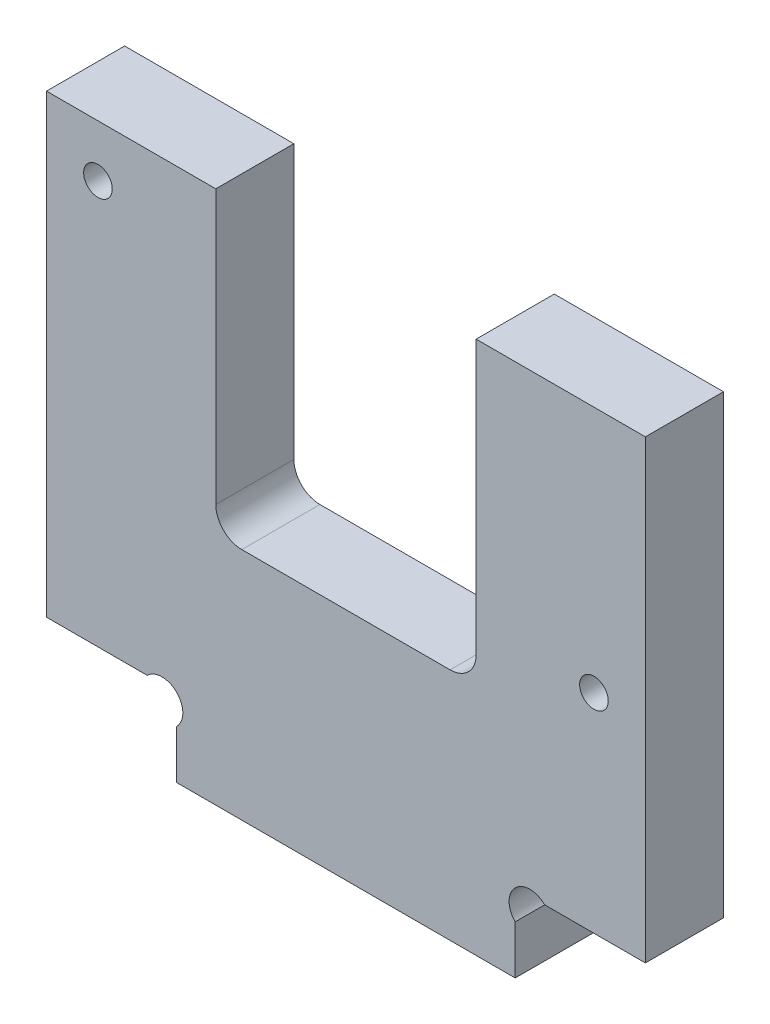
from build123d import *

# Parameters (mm, degrees)
ESQUISSE1_R        = 1.1
BOSS_EXTRU_1_DEPTH = 6


with BuildPart() as part:
    # Esquisse1 → Boss.-Extru.1 (new body)
    with BuildSketch(Plane.XY):
        with BuildLine():
            Line((10, 0), (36, 0))
            Line((36, 0), (36, 3.7372583))
            ThreePointArc((36, 3.7372583), (36, 6), (38.2627417, 6))
            Line((38.2627417, 6), (46, 6))
            Line((46, 6), (46, 41))
            Line((46, 41), (33, 41))
            Line((33, 41), (33, 20))
            ThreePointArc((33, 20), (32.414213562, 18.585786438), (31, 18))
            Line((31, 18), (15, 18))
            ThreePointArc((15, 18), (13.585786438, 18.585786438), (13, 20))
            Line((13, 20), (13, 41))
            Line((13, 41), (0, 41))
            Line((0, 41), (0, 6))
            Line((0, 6), (7.7372583, 6))
            ThreePointArc((7.7372583, 6), (10, 6), (10, 3.7372583))
            Line((10, 3.7372583), (10, 0))
        make_face()
        with Locations((42.05, 22)):
            Circle(ESQUISSE1_R, mode=Mode.SUBTRACT)
        with Locations((3.95, 37)):
            Circle(ESQUISSE1_R, mode=Mode.SUBTRACT)
    extrude(amount=BOSS_EXTRU_1_DEPTH)


solid = part.part
